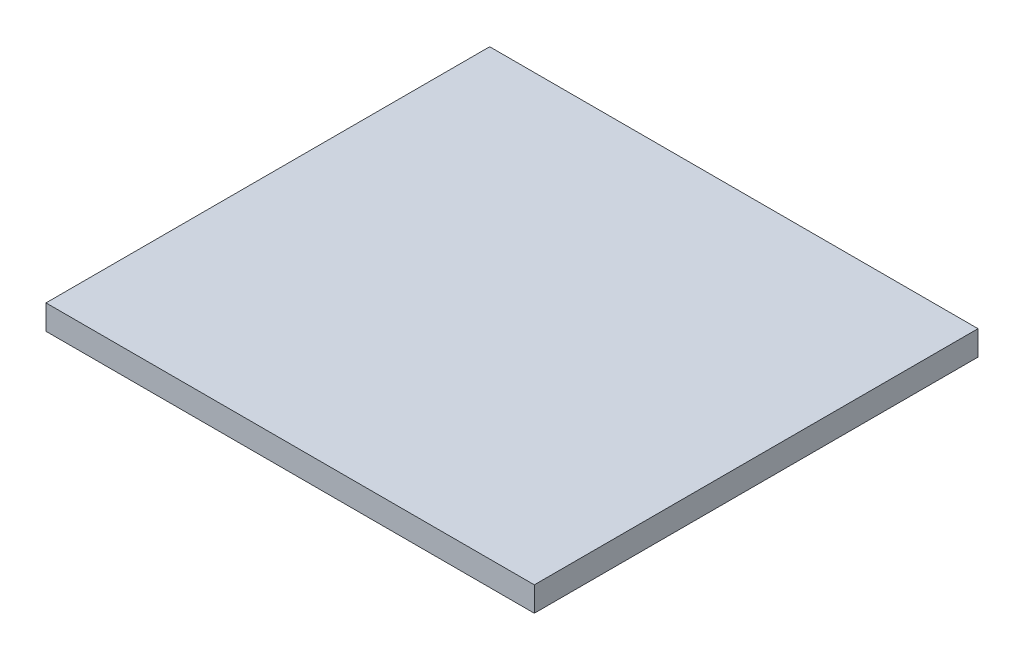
ISO-10303-21;
HEADER;
FILE_DESCRIPTION(('STEP AP214'),'2;1');
FILE_NAME('part.step','',(''),(''),'','','');
FILE_SCHEMA(('AUTOMOTIVE_DESIGN { 1 0 10303 214 1 1 1 1 }'));
ENDSEC;
DATA;
#1=APPLICATION_CONTEXT('core data for automotive mechanical design processes');
#2=APPLICATION_PROTOCOL_DEFINITION('international standard','automotive_design',2000,#1);
#3=PRODUCT_CONTEXT('',#1,'mechanical');
#4=PRODUCT('Part','Part','',(#3));
#5=PRODUCT_RELATED_PRODUCT_CATEGORY('part','',(#4));
#6=PRODUCT_DEFINITION_FORMATION('','',#4);
#7=PRODUCT_DEFINITION_CONTEXT('part definition',#1,'design');
#8=PRODUCT_DEFINITION('design','',#6,#7);
#9=PRODUCT_DEFINITION_SHAPE('','',#8);
#10=(LENGTH_UNIT() NAMED_UNIT(*) SI_UNIT(.MILLI.,.METRE.));
#11=(NAMED_UNIT(*) PLANE_ANGLE_UNIT() SI_UNIT($,.RADIAN.));
#12=(NAMED_UNIT(*) SI_UNIT($,.STERADIAN.) SOLID_ANGLE_UNIT());
#13=UNCERTAINTY_MEASURE_WITH_UNIT(LENGTH_MEASURE(1.E-05),#10,'distance_accuracy_value','');
#14=(GEOMETRIC_REPRESENTATION_CONTEXT(3) GLOBAL_UNCERTAINTY_ASSIGNED_CONTEXT((#13)) GLOBAL_UNIT_ASSIGNED_CONTEXT((#10,
#11,#12)) REPRESENTATION_CONTEXT('',''));
#15=CARTESIAN_POINT('',(0.,0.,0.));
#16=DIRECTION('',(0.,0.,1.));
#17=DIRECTION('',(1.,0.,0.));
#18=AXIS2_PLACEMENT_3D('',#15,#16,#17);
#19=CARTESIAN_POINT('',(-49.544947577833,5.,44.4304717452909));
#20=DIRECTION('',(1.,0.,0.));
#21=DIRECTION('',(0.,0.,-1.));
#22=AXIS2_PLACEMENT_3D('',#19,#20,#21);
#23=PLANE('',#22);
#24=DIRECTION('',(0.,0.,1.));
#25=VECTOR('',#24,1.);
#26=CARTESIAN_POINT('',(-49.544947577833,0.,44.4304717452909));
#27=LINE('',#26,#25);
#28=CARTESIAN_POINT('',(-49.544947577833,0.,-45.5979715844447));
#29=VERTEX_POINT('',#28);
#30=CARTESIAN_POINT('',(-49.544947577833,0.,44.4304717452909));
#31=VERTEX_POINT('',#30);
#32=EDGE_CURVE('E97',#29,#31,#27,.T.);
#33=ORIENTED_EDGE('',*,*,#32,.T.);
#34=DIRECTION('',(0.,-1.,0.));
#35=VECTOR('',#34,1.);
#36=CARTESIAN_POINT('',(-49.544947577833,5.,44.4304717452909));
#37=LINE('',#36,#35);
#38=CARTESIAN_POINT('',(-49.544947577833,5.,44.4304717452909));
#39=VERTEX_POINT('',#38);
#40=EDGE_CURVE('E11',#39,#31,#37,.T.);
#41=ORIENTED_EDGE('',*,*,#40,.F.);
#42=DIRECTION('',(0.,0.,1.));
#43=VECTOR('',#42,1.);
#44=CARTESIAN_POINT('',(-49.544947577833,5.,44.4304717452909));
#45=LINE('',#44,#43);
#46=CARTESIAN_POINT('',(-49.544947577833,5.,-45.5979715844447));
#47=VERTEX_POINT('',#46);
#48=EDGE_CURVE('E85',#47,#39,#45,.T.);
#49=ORIENTED_EDGE('',*,*,#48,.F.);
#50=DIRECTION('',(0.,-1.,0.));
#51=VECTOR('',#50,1.);
#52=CARTESIAN_POINT('',(-49.544947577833,5.,-45.5979715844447));
#53=LINE('',#52,#51);
#54=EDGE_CURVE('E93',#47,#29,#53,.T.);
#55=ORIENTED_EDGE('',*,*,#54,.T.);
#56=EDGE_LOOP('',(#33,#41,#49,#55));
#57=FACE_BOUND('',#56,.T.);
#58=ADVANCED_FACE('F34',(#57),#23,.F.);
#59=CARTESIAN_POINT('',(49.544947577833,5.,44.4304717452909));
#60=DIRECTION('',(0.,0.,-1.));
#61=DIRECTION('',(-1.,0.,0.));
#62=AXIS2_PLACEMENT_3D('',#59,#60,#61);
#63=PLANE('',#62);
#64=DIRECTION('',(1.,0.,0.));
#65=VECTOR('',#64,1.);
#66=CARTESIAN_POINT('',(49.544947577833,0.,44.4304717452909));
#67=LINE('',#66,#65);
#68=CARTESIAN_POINT('',(49.544947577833,0.,44.4304717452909));
#69=VERTEX_POINT('',#68);
#70=EDGE_CURVE('E89',#31,#69,#67,.T.);
#71=ORIENTED_EDGE('',*,*,#70,.T.);
#72=DIRECTION('',(0.,-1.,0.));
#73=VECTOR('',#72,1.);
#74=CARTESIAN_POINT('',(49.544947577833,5.,44.4304717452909));
#75=LINE('',#74,#73);
#76=CARTESIAN_POINT('',(49.544947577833,5.,44.4304717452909));
#77=VERTEX_POINT('',#76);
#78=EDGE_CURVE('E42',#77,#69,#75,.T.);
#79=ORIENTED_EDGE('',*,*,#78,.F.);
#80=DIRECTION('',(1.,0.,0.));
#81=VECTOR('',#80,1.);
#82=CARTESIAN_POINT('',(49.544947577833,5.,44.4304717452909));
#83=LINE('',#82,#81);
#84=EDGE_CURVE('E80',#39,#77,#83,.T.);
#85=ORIENTED_EDGE('',*,*,#84,.F.);
#86=ORIENTED_EDGE('',*,*,#40,.T.);
#87=EDGE_LOOP('',(#71,#79,#85,#86));
#88=FACE_BOUND('',#87,.T.);
#89=ADVANCED_FACE('F88',(#88),#63,.F.);
#90=CARTESIAN_POINT('',(49.544947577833,5.,44.4304717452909));
#91=DIRECTION('',(-1.,0.,0.));
#92=DIRECTION('',(0.,0.,1.));
#93=AXIS2_PLACEMENT_3D('',#90,#91,#92);
#94=PLANE('',#93);
#95=DIRECTION('',(0.,0.,-1.));
#96=VECTOR('',#95,1.);
#97=CARTESIAN_POINT('',(49.544947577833,0.,44.4304717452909));
#98=LINE('',#97,#96);
#99=CARTESIAN_POINT('',(49.544947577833,0.,-45.5979715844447));
#100=VERTEX_POINT('',#99);
#101=EDGE_CURVE('E67',#69,#100,#98,.T.);
#102=ORIENTED_EDGE('',*,*,#101,.T.);
#103=DIRECTION('',(0.,-1.,0.));
#104=VECTOR('',#103,1.);
#105=CARTESIAN_POINT('',(49.544947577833,5.,-45.5979715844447));
#106=LINE('',#105,#104);
#107=CARTESIAN_POINT('',(49.544947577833,5.,-45.5979715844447));
#108=VERTEX_POINT('',#107);
#109=EDGE_CURVE('E90',#108,#100,#106,.T.);
#110=ORIENTED_EDGE('',*,*,#109,.F.);
#111=DIRECTION('',(0.,0.,-1.));
#112=VECTOR('',#111,1.);
#113=CARTESIAN_POINT('',(49.544947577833,5.,44.4304717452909));
#114=LINE('',#113,#112);
#115=EDGE_CURVE('E83',#77,#108,#114,.T.);
#116=ORIENTED_EDGE('',*,*,#115,.F.);
#117=ORIENTED_EDGE('',*,*,#78,.T.);
#118=EDGE_LOOP('',(#102,#110,#116,#117));
#119=FACE_BOUND('',#118,.T.);
#120=ADVANCED_FACE('F91',(#119),#94,.F.);
#121=CARTESIAN_POINT('',(49.544947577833,5.,-45.5979715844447));
#122=DIRECTION('',(0.,0.,1.));
#123=DIRECTION('',(1.,0.,0.));
#124=AXIS2_PLACEMENT_3D('',#121,#122,#123);
#125=PLANE('',#124);
#126=DIRECTION('',(-1.,0.,0.));
#127=VECTOR('',#126,1.);
#128=CARTESIAN_POINT('',(49.544947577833,0.,-45.5979715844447));
#129=LINE('',#128,#127);
#130=EDGE_CURVE('E73',#100,#29,#129,.T.);
#131=ORIENTED_EDGE('',*,*,#130,.T.);
#132=ORIENTED_EDGE('',*,*,#54,.F.);
#133=DIRECTION('',(-1.,0.,0.));
#134=VECTOR('',#133,1.);
#135=CARTESIAN_POINT('',(49.544947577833,5.,-45.5979715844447));
#136=LINE('',#135,#134);
#137=EDGE_CURVE('E50',#108,#47,#136,.T.);
#138=ORIENTED_EDGE('',*,*,#137,.F.);
#139=ORIENTED_EDGE('',*,*,#109,.T.);
#140=EDGE_LOOP('',(#131,#132,#138,#139));
#141=FACE_BOUND('',#140,.T.);
#142=ADVANCED_FACE('F104',(#141),#125,.F.);
#143=CARTESIAN_POINT('',(0.,5.,0.));
#144=DIRECTION('',(0.,1.,0.));
#145=DIRECTION('',(0.,0.,1.));
#146=AXIS2_PLACEMENT_3D('',#143,#144,#145);
#147=PLANE('',#146);
#148=ORIENTED_EDGE('',*,*,#48,.T.);
#149=ORIENTED_EDGE('',*,*,#84,.T.);
#150=ORIENTED_EDGE('',*,*,#115,.T.);
#151=ORIENTED_EDGE('',*,*,#137,.T.);
#152=EDGE_LOOP('',(#148,#149,#150,#151));
#153=FACE_BOUND('',#152,.T.);
#154=ADVANCED_FACE('F81',(#153),#147,.T.);
#155=CARTESIAN_POINT('',(0.,0.,0.));
#156=DIRECTION('',(0.,1.,0.));
#157=DIRECTION('',(0.,0.,1.));
#158=AXIS2_PLACEMENT_3D('',#155,#156,#157);
#159=PLANE('',#158);
#160=ORIENTED_EDGE('',*,*,#32,.F.);
#161=ORIENTED_EDGE('',*,*,#130,.F.);
#162=ORIENTED_EDGE('',*,*,#101,.F.);
#163=ORIENTED_EDGE('',*,*,#70,.F.);
#164=EDGE_LOOP('',(#160,#161,#162,#163));
#165=FACE_BOUND('',#164,.T.);
#166=ADVANCED_FACE('F107',(#165),#159,.F.);
#167=CLOSED_SHELL('',(#58,#89,#120,#142,#154,#166));
#168=MANIFOLD_SOLID_BREP('B2',#167);
#169=ADVANCED_BREP_SHAPE_REPRESENTATION('',(#18,#168),#14);
#170=SHAPE_DEFINITION_REPRESENTATION(#9,#169);
ENDSEC;
END-ISO-10303-21;
